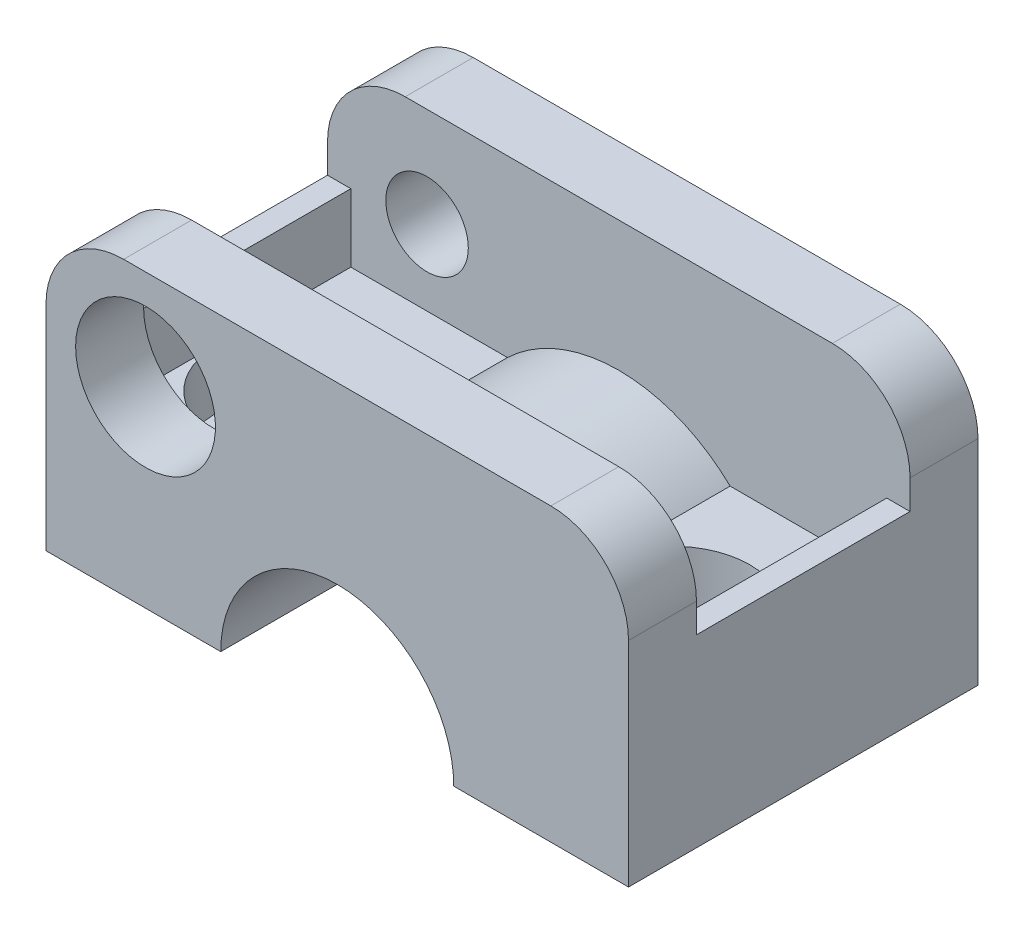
ISO-10303-21;
HEADER;
FILE_DESCRIPTION(('STEP AP214'),'2;1');
FILE_NAME('part.step','',(''),(''),'','','');
FILE_SCHEMA(('AUTOMOTIVE_DESIGN { 1 0 10303 214 1 1 1 1 }'));
ENDSEC;
DATA;
#1=APPLICATION_CONTEXT('core data for automotive mechanical design processes');
#2=APPLICATION_PROTOCOL_DEFINITION('international standard','automotive_design',2000,#1);
#3=PRODUCT_CONTEXT('',#1,'mechanical');
#4=PRODUCT('Part','Part','',(#3));
#5=PRODUCT_RELATED_PRODUCT_CATEGORY('part','',(#4));
#6=PRODUCT_DEFINITION_FORMATION('','',#4);
#7=PRODUCT_DEFINITION_CONTEXT('part definition',#1,'design');
#8=PRODUCT_DEFINITION('design','',#6,#7);
#9=PRODUCT_DEFINITION_SHAPE('','',#8);
#10=(LENGTH_UNIT() NAMED_UNIT(*) SI_UNIT(.MILLI.,.METRE.));
#11=(NAMED_UNIT(*) PLANE_ANGLE_UNIT() SI_UNIT($,.RADIAN.));
#12=(NAMED_UNIT(*) SI_UNIT($,.STERADIAN.) SOLID_ANGLE_UNIT());
#13=UNCERTAINTY_MEASURE_WITH_UNIT(LENGTH_MEASURE(1.E-05),#10,'distance_accuracy_value','');
#14=(GEOMETRIC_REPRESENTATION_CONTEXT(3) GLOBAL_UNCERTAINTY_ASSIGNED_CONTEXT((#13)) GLOBAL_UNIT_ASSIGNED_CONTEXT((#10,
#11,#12)) REPRESENTATION_CONTEXT('',''));
#15=CARTESIAN_POINT('',(0.,0.,0.));
#16=DIRECTION('',(0.,0.,1.));
#17=DIRECTION('',(1.,0.,0.));
#18=AXIS2_PLACEMENT_3D('',#15,#16,#17);
#19=CARTESIAN_POINT('',(13.8,6.,-5.5));
#20=DIRECTION('',(0.,-1.,0.));
#21=DIRECTION('',(0.,0.,-1.));
#22=AXIS2_PLACEMENT_3D('',#19,#20,#21);
#23=PLANE('',#22);
#24=DIRECTION('',(0.,0.,1.));
#25=VECTOR('',#24,1.);
#26=CARTESIAN_POINT('',(5.73498038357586,6.,-5.5));
#27=LINE('',#26,#25);
#28=CARTESIAN_POINT('',(5.73498038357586,6.,5.5));
#29=VERTEX_POINT('',#28);
#30=CARTESIAN_POINT('',(5.73498038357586,6.,-5.5));
#31=VERTEX_POINT('',#30);
#32=EDGE_CURVE('E58',#29,#31,#27,.F.);
#33=ORIENTED_EDGE('',*,*,#32,.F.);
#34=DIRECTION('',(1.,0.,0.));
#35=VECTOR('',#34,1.);
#36=CARTESIAN_POINT('',(0.,6.,5.5));
#37=LINE('',#36,#35);
#38=CARTESIAN_POINT('',(9.75000000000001,6.,5.5));
#39=VERTEX_POINT('',#38);
#40=EDGE_CURVE('E248',#39,#29,#37,.F.);
#41=ORIENTED_EDGE('',*,*,#40,.F.);
#42=CARTESIAN_POINT('',(9.75000000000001,6.,1.5));
#43=DIRECTION('',(0.,-1.,0.));
#44=DIRECTION('',(1.,0.,0.));
#45=AXIS2_PLACEMENT_3D('',#42,#43,#44);
#46=CIRCLE('',#45,4.);
#47=CARTESIAN_POINT('',(13.75,6.,1.5));
#48=VERTEX_POINT('',#47);
#49=EDGE_CURVE('E348',#48,#39,#46,.F.);
#50=ORIENTED_EDGE('',*,*,#49,.F.);
#51=EDGE_CURVE('E349',#39,#48,#46,.F.);
#52=ORIENTED_EDGE('',*,*,#51,.F.);
#53=CARTESIAN_POINT('',(13.8,6.,5.5));
#54=VERTEX_POINT('',#53);
#55=EDGE_CURVE('E33',#54,#39,#37,.F.);
#56=ORIENTED_EDGE('',*,*,#55,.F.);
#57=DIRECTION('',(0.,0.,-1.));
#58=VECTOR('',#57,1.);
#59=CARTESIAN_POINT('',(13.8,6.,-5.5));
#60=LINE('',#59,#58);
#61=CARTESIAN_POINT('',(13.8,6.,-5.5));
#62=VERTEX_POINT('',#61);
#63=EDGE_CURVE('E197',#54,#62,#60,.T.);
#64=ORIENTED_EDGE('',*,*,#63,.T.);
#65=DIRECTION('',(1.,0.,0.));
#66=VECTOR('',#65,1.);
#67=CARTESIAN_POINT('',(0.,6.,-5.5));
#68=LINE('',#67,#66);
#69=EDGE_CURVE('E195',#31,#62,#68,.T.);
#70=ORIENTED_EDGE('',*,*,#69,.F.);
#71=EDGE_LOOP('',(#33,#41,#50,#52,#56,#64,#70));
#72=FACE_BOUND('',#71,.T.);
#73=ADVANCED_FACE('F15',(#72),#23,.F.);
#74=CARTESIAN_POINT('',(0.,10.5256042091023,-5.5));
#75=DIRECTION('',(0.,0.,1.));
#76=DIRECTION('',(1.,0.,0.));
#77=AXIS2_PLACEMENT_3D('',#74,#75,#76);
#78=PLANE('',#77);
#79=CARTESIAN_POINT('',(-9.875,9.87499999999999,-5.5));
#80=DIRECTION('',(0.,0.,1.));
#81=DIRECTION('',(1.,0.,0.));
#82=AXIS2_PLACEMENT_3D('',#79,#80,#81);
#83=CIRCLE('',#82,2.125);
#84=CARTESIAN_POINT('',(-7.75,9.87499999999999,-5.5));
#85=VERTEX_POINT('',#84);
#86=EDGE_CURVE('E416',#85,#85,#83,.F.);
#87=ORIENTED_EDGE('',*,*,#86,.T.);
#88=EDGE_LOOP('',(#87));
#89=FACE_BOUND('',#88,.T.);
#90=CARTESIAN_POINT('',(11.,11.,-5.5));
#91=DIRECTION('',(0.,0.,1.));
#92=DIRECTION('',(1.,0.,0.));
#93=AXIS2_PLACEMENT_3D('',#90,#91,#92);
#94=CIRCLE('',#93,3.99999999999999);
#95=CARTESIAN_POINT('',(11.,15.,-5.5));
#96=VERTEX_POINT('',#95);
#97=CARTESIAN_POINT('',(15.,11.,-5.5));
#98=VERTEX_POINT('',#97);
#99=EDGE_CURVE('E412',#96,#98,#94,.F.);
#100=ORIENTED_EDGE('',*,*,#99,.F.);
#101=DIRECTION('',(1.,0.,0.));
#102=VECTOR('',#101,1.);
#103=CARTESIAN_POINT('',(-11.,15.,-5.5));
#104=LINE('',#103,#102);
#105=CARTESIAN_POINT('',(-11.,15.,-5.5));
#106=VERTEX_POINT('',#105);
#107=EDGE_CURVE('E406',#106,#96,#104,.T.);
#108=ORIENTED_EDGE('',*,*,#107,.F.);
#109=CARTESIAN_POINT('',(-11.,11.,-5.5));
#110=DIRECTION('',(0.,0.,1.));
#111=DIRECTION('',(1.,0.,0.));
#112=AXIS2_PLACEMENT_3D('',#109,#110,#111);
#113=CIRCLE('',#112,4.);
#114=CARTESIAN_POINT('',(-15.,11.,-5.5));
#115=VERTEX_POINT('',#114);
#116=EDGE_CURVE('E411',#115,#106,#113,.F.);
#117=ORIENTED_EDGE('',*,*,#116,.F.);
#118=DIRECTION('',(0.,1.,0.));
#119=VECTOR('',#118,1.);
#120=CARTESIAN_POINT('',(-15.,0.,-5.5));
#121=LINE('',#120,#119);
#122=CARTESIAN_POINT('',(-15.,9.5,-5.5));
#123=VERTEX_POINT('',#122);
#124=EDGE_CURVE('E414',#123,#115,#121,.T.);
#125=ORIENTED_EDGE('',*,*,#124,.F.);
#126=DIRECTION('',(1.,0.,0.));
#127=VECTOR('',#126,1.);
#128=CARTESIAN_POINT('',(0.,9.5,-5.5));
#129=LINE('',#128,#127);
#130=CARTESIAN_POINT('',(-13.8,9.5,-5.5));
#131=VERTEX_POINT('',#130);
#132=EDGE_CURVE('E67',#123,#131,#129,.T.);
#133=ORIENTED_EDGE('',*,*,#132,.T.);
#134=DIRECTION('',(0.,1.,0.));
#135=VECTOR('',#134,1.);
#136=CARTESIAN_POINT('',(-13.8,10.5256042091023,-5.5));
#137=LINE('',#136,#135);
#138=CARTESIAN_POINT('',(-13.8,6.,-5.5));
#139=VERTEX_POINT('',#138);
#140=EDGE_CURVE('E167',#131,#139,#137,.F.);
#141=ORIENTED_EDGE('',*,*,#140,.T.);
#142=DIRECTION('',(1.,0.,0.));
#143=VECTOR('',#142,1.);
#144=CARTESIAN_POINT('',(-9.76749019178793,6.,-5.5));
#145=LINE('',#144,#143);
#146=CARTESIAN_POINT('',(-5.73498055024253,6.,-5.5));
#147=VERTEX_POINT('',#146);
#148=EDGE_CURVE('E161',#139,#147,#145,.T.);
#149=ORIENTED_EDGE('',*,*,#148,.T.);
#150=CARTESIAN_POINT('',(0.,0.,-5.5));
#151=DIRECTION('',(0.,0.,1.));
#152=DIRECTION('',(1.,0.,0.));
#153=AXIS2_PLACEMENT_3D('',#150,#151,#152);
#154=CIRCLE('',#153,8.3);
#155=EDGE_CURVE('E172',#147,#31,#154,.F.);
#156=ORIENTED_EDGE('',*,*,#155,.T.);
#157=ORIENTED_EDGE('',*,*,#69,.T.);
#158=DIRECTION('',(0.,1.,0.));
#159=VECTOR('',#158,1.);
#160=CARTESIAN_POINT('',(13.8,10.5256042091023,-5.5));
#161=LINE('',#160,#159);
#162=CARTESIAN_POINT('',(13.8,9.5,-5.5));
#163=VERTEX_POINT('',#162);
#164=EDGE_CURVE('E204',#62,#163,#161,.T.);
#165=ORIENTED_EDGE('',*,*,#164,.T.);
#166=DIRECTION('',(1.,0.,0.));
#167=VECTOR('',#166,1.);
#168=CARTESIAN_POINT('',(0.,9.5,-5.5));
#169=LINE('',#168,#167);
#170=CARTESIAN_POINT('',(15.,9.5,-5.5));
#171=VERTEX_POINT('',#170);
#172=EDGE_CURVE('E206',#163,#171,#169,.T.);
#173=ORIENTED_EDGE('',*,*,#172,.T.);
#174=DIRECTION('',(0.,1.,0.));
#175=VECTOR('',#174,1.);
#176=CARTESIAN_POINT('',(15.,11.,-5.5));
#177=LINE('',#176,#175);
#178=EDGE_CURVE('E231',#98,#171,#177,.F.);
#179=ORIENTED_EDGE('',*,*,#178,.F.);
#180=EDGE_LOOP('',(#100,#108,#117,#125,#133,#141,#149,#156,#157,#165,#173,#179));
#181=FACE_BOUND('',#180,.T.);
#182=ADVANCED_FACE('F169',(#89,#181),#78,.T.);
#183=CARTESIAN_POINT('',(13.8,9.5,-5.5));
#184=DIRECTION('',(1.,0.,0.));
#185=DIRECTION('',(0.,0.,-1.));
#186=AXIS2_PLACEMENT_3D('',#183,#184,#185);
#187=PLANE('',#186);
#188=DIRECTION('',(0.,0.,-1.));
#189=VECTOR('',#188,1.);
#190=CARTESIAN_POINT('',(13.8,9.5,-5.5));
#191=LINE('',#190,#189);
#192=CARTESIAN_POINT('',(13.8,9.5,5.5));
#193=VERTEX_POINT('',#192);
#194=EDGE_CURVE('E200',#193,#163,#191,.T.);
#195=ORIENTED_EDGE('',*,*,#194,.T.);
#196=ORIENTED_EDGE('',*,*,#164,.F.);
#197=ORIENTED_EDGE('',*,*,#63,.F.);
#198=DIRECTION('',(0.,1.,0.));
#199=VECTOR('',#198,1.);
#200=CARTESIAN_POINT('',(13.8,9.5,5.5));
#201=LINE('',#200,#199);
#202=EDGE_CURVE('E194',#193,#54,#201,.F.);
#203=ORIENTED_EDGE('',*,*,#202,.F.);
#204=EDGE_LOOP('',(#195,#196,#197,#203));
#205=FACE_BOUND('',#204,.T.);
#206=ADVANCED_FACE('F220',(#205),#187,.F.);
#207=CARTESIAN_POINT('',(0.,0.,-5.5));
#208=DIRECTION('',(0.,0.,1.));
#209=DIRECTION('',(1.,0.,0.));
#210=AXIS2_PLACEMENT_3D('',#207,#208,#209);
#211=CYLINDRICAL_SURFACE('',#210,8.3);
#212=ORIENTED_EDGE('',*,*,#155,.F.);
#213=DIRECTION('',(0.,0.,1.));
#214=VECTOR('',#213,1.);
#215=CARTESIAN_POINT('',(-5.73498038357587,6.,0.));
#216=LINE('',#215,#214);
#217=CARTESIAN_POINT('',(-5.73498038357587,6.,5.49999983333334));
#218=VERTEX_POINT('',#217);
#219=EDGE_CURVE('E166',#147,#218,#216,.T.);
#220=ORIENTED_EDGE('',*,*,#219,.T.);
#221=CARTESIAN_POINT('',(0.,0.,5.5));
#222=DIRECTION('',(0.,0.,1.));
#223=DIRECTION('',(1.,0.,0.));
#224=AXIS2_PLACEMENT_3D('',#221,#222,#223);
#225=CIRCLE('',#224,8.3);
#226=EDGE_CURVE('E192',#218,#29,#225,.F.);
#227=ORIENTED_EDGE('',*,*,#226,.T.);
#228=ORIENTED_EDGE('',*,*,#32,.T.);
#229=EDGE_LOOP('',(#212,#220,#227,#228));
#230=FACE_BOUND('',#229,.T.);
#231=ADVANCED_FACE('F211',(#230),#211,.T.);
#232=CARTESIAN_POINT('',(-13.8,6.,-5.5));
#233=DIRECTION('',(-1.,0.,0.));
#234=DIRECTION('',(0.,0.,1.));
#235=AXIS2_PLACEMENT_3D('',#232,#233,#234);
#236=PLANE('',#235);
#237=DIRECTION('',(0.,0.,1.));
#238=VECTOR('',#237,1.);
#239=CARTESIAN_POINT('',(-13.8,6.,0.));
#240=LINE('',#239,#238);
#241=CARTESIAN_POINT('',(-13.8,6.,5.49999983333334));
#242=VERTEX_POINT('',#241);
#243=EDGE_CURVE('E18',#139,#242,#240,.T.);
#244=ORIENTED_EDGE('',*,*,#243,.F.);
#245=ORIENTED_EDGE('',*,*,#140,.F.);
#246=DIRECTION('',(0.,0.,-1.));
#247=VECTOR('',#246,1.);
#248=CARTESIAN_POINT('',(-13.8,9.5,-5.5));
#249=LINE('',#248,#247);
#250=CARTESIAN_POINT('',(-13.8,9.5,5.5));
#251=VERTEX_POINT('',#250);
#252=EDGE_CURVE('E191',#131,#251,#249,.F.);
#253=ORIENTED_EDGE('',*,*,#252,.T.);
#254=DIRECTION('',(0.,1.,0.));
#255=VECTOR('',#254,1.);
#256=CARTESIAN_POINT('',(-13.8,6.,5.5));
#257=LINE('',#256,#255);
#258=EDGE_CURVE('E176',#242,#251,#257,.T.);
#259=ORIENTED_EDGE('',*,*,#258,.F.);
#260=EDGE_LOOP('',(#244,#245,#253,#259));
#261=FACE_BOUND('',#260,.T.);
#262=ADVANCED_FACE('F174',(#261),#236,.F.);
#263=CARTESIAN_POINT('',(0.,10.5256042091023,5.5));
#264=DIRECTION('',(0.,0.,1.));
#265=DIRECTION('',(1.,0.,0.));
#266=AXIS2_PLACEMENT_3D('',#263,#264,#265);
#267=PLANE('',#266);
#268=CARTESIAN_POINT('',(-9.875,9.87499999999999,5.5));
#269=DIRECTION('',(0.,0.,-1.));
#270=DIRECTION('',(-1.,0.,0.));
#271=AXIS2_PLACEMENT_3D('',#268,#269,#270);
#272=CIRCLE('',#271,3.6);
#273=CARTESIAN_POINT('',(-13.475,9.87499999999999,5.5));
#274=VERTEX_POINT('',#273);
#275=EDGE_CURVE('E190',#274,#274,#272,.F.);
#276=ORIENTED_EDGE('',*,*,#275,.T.);
#277=EDGE_LOOP('',(#276));
#278=FACE_BOUND('',#277,.T.);
#279=CARTESIAN_POINT('',(11.,11.,5.5));
#280=DIRECTION('',(0.,0.,1.));
#281=DIRECTION('',(1.,0.,0.));
#282=AXIS2_PLACEMENT_3D('',#279,#280,#281);
#283=CIRCLE('',#282,3.99999999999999);
#284=CARTESIAN_POINT('',(15.,11.,5.5));
#285=VERTEX_POINT('',#284);
#286=CARTESIAN_POINT('',(11.,15.,5.5));
#287=VERTEX_POINT('',#286);
#288=EDGE_CURVE('E241',#285,#287,#283,.T.);
#289=ORIENTED_EDGE('',*,*,#288,.F.);
#290=DIRECTION('',(0.,1.,0.));
#291=VECTOR('',#290,1.);
#292=CARTESIAN_POINT('',(15.,10.5256042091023,5.5));
#293=LINE('',#292,#291);
#294=CARTESIAN_POINT('',(15.,9.5,5.5));
#295=VERTEX_POINT('',#294);
#296=EDGE_CURVE('E243',#295,#285,#293,.T.);
#297=ORIENTED_EDGE('',*,*,#296,.F.);
#298=DIRECTION('',(1.,0.,0.));
#299=VECTOR('',#298,1.);
#300=CARTESIAN_POINT('',(15.,9.5,5.5));
#301=LINE('',#300,#299);
#302=EDGE_CURVE('E246',#295,#193,#301,.F.);
#303=ORIENTED_EDGE('',*,*,#302,.T.);
#304=ORIENTED_EDGE('',*,*,#202,.T.);
#305=ORIENTED_EDGE('',*,*,#55,.T.);
#306=ORIENTED_EDGE('',*,*,#40,.T.);
#307=ORIENTED_EDGE('',*,*,#226,.F.);
#308=DIRECTION('',(1.,0.,0.));
#309=VECTOR('',#308,1.);
#310=CARTESIAN_POINT('',(-9.76749019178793,6.,5.5));
#311=LINE('',#310,#309);
#312=CARTESIAN_POINT('',(-9.75,6.,5.5));
#313=VERTEX_POINT('',#312);
#314=EDGE_CURVE('E208',#313,#218,#311,.T.);
#315=ORIENTED_EDGE('',*,*,#314,.F.);
#316=DIRECTION('',(1.,0.,0.));
#317=VECTOR('',#316,1.);
#318=CARTESIAN_POINT('',(-9.76749019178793,6.,5.5));
#319=LINE('',#318,#317);
#320=EDGE_CURVE('E10',#242,#313,#319,.T.);
#321=ORIENTED_EDGE('',*,*,#320,.F.);
#322=ORIENTED_EDGE('',*,*,#258,.T.);
#323=DIRECTION('',(1.,0.,0.));
#324=VECTOR('',#323,1.);
#325=CARTESIAN_POINT('',(-13.8,9.5,5.5));
#326=LINE('',#325,#324);
#327=CARTESIAN_POINT('',(-15.,9.5,5.5));
#328=VERTEX_POINT('',#327);
#329=EDGE_CURVE('E250',#251,#328,#326,.F.);
#330=ORIENTED_EDGE('',*,*,#329,.T.);
#331=DIRECTION('',(0.,1.,0.));
#332=VECTOR('',#331,1.);
#333=CARTESIAN_POINT('',(-15.,10.5256042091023,5.5));
#334=LINE('',#333,#332);
#335=CARTESIAN_POINT('',(-15.,11.,5.5));
#336=VERTEX_POINT('',#335);
#337=EDGE_CURVE('E252',#336,#328,#334,.F.);
#338=ORIENTED_EDGE('',*,*,#337,.F.);
#339=CARTESIAN_POINT('',(-11.,11.,5.5));
#340=DIRECTION('',(0.,0.,1.));
#341=DIRECTION('',(1.,0.,0.));
#342=AXIS2_PLACEMENT_3D('',#339,#340,#341);
#343=CIRCLE('',#342,4.);
#344=CARTESIAN_POINT('',(-11.,15.,5.5));
#345=VERTEX_POINT('',#344);
#346=EDGE_CURVE('E255',#345,#336,#343,.T.);
#347=ORIENTED_EDGE('',*,*,#346,.F.);
#348=DIRECTION('',(1.,0.,0.));
#349=VECTOR('',#348,1.);
#350=CARTESIAN_POINT('',(-11.,15.,5.5));
#351=LINE('',#350,#349);
#352=EDGE_CURVE('E258',#287,#345,#351,.F.);
#353=ORIENTED_EDGE('',*,*,#352,.F.);
#354=EDGE_LOOP('',(#289,#297,#303,#304,#305,#306,#307,#315,#321,#322,#330,#338,#347,#353));
#355=FACE_BOUND('',#354,.T.);
#356=ADVANCED_FACE('F452',(#278,#355),#267,.F.);
#357=CARTESIAN_POINT('',(-9.875,9.87499999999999,9.));
#358=DIRECTION('',(0.,0.,-1.));
#359=DIRECTION('',(-1.,0.,0.));
#360=AXIS2_PLACEMENT_3D('',#357,#358,#359);
#361=CYLINDRICAL_SURFACE('',#360,3.6);
#362=CARTESIAN_POINT('',(-9.875,9.87499999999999,9.));
#363=DIRECTION('',(0.,0.,-1.));
#364=DIRECTION('',(-1.,0.,0.));
#365=AXIS2_PLACEMENT_3D('',#362,#363,#364);
#366=CIRCLE('',#365,3.6);
#367=CARTESIAN_POINT('',(-13.475,9.87499999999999,9.));
#368=VERTEX_POINT('',#367);
#369=EDGE_CURVE('E261',#368,#368,#366,.T.);
#370=ORIENTED_EDGE('',*,*,#369,.F.);
#371=EDGE_LOOP('',(#370));
#372=FACE_BOUND('',#371,.T.);
#373=ORIENTED_EDGE('',*,*,#275,.F.);
#374=EDGE_LOOP('',(#373));
#375=FACE_BOUND('',#374,.T.);
#376=ADVANCED_FACE('F454',(#372,#375),#361,.F.);
#377=CARTESIAN_POINT('',(11.,11.,0.));
#378=DIRECTION('',(0.,0.,1.));
#379=DIRECTION('',(1.,0.,0.));
#380=AXIS2_PLACEMENT_3D('',#377,#378,#379);
#381=CYLINDRICAL_SURFACE('',#380,3.99999999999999);
#382=CARTESIAN_POINT('',(11.,11.,9.));
#383=DIRECTION('',(0.,0.,1.));
#384=DIRECTION('',(1.,0.,0.));
#385=AXIS2_PLACEMENT_3D('',#382,#383,#384);
#386=CIRCLE('',#385,3.99999999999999);
#387=CARTESIAN_POINT('',(15.,11.,9.));
#388=VERTEX_POINT('',#387);
#389=CARTESIAN_POINT('',(11.,15.,9.));
#390=VERTEX_POINT('',#389);
#391=EDGE_CURVE('E264',#388,#390,#386,.T.);
#392=ORIENTED_EDGE('',*,*,#391,.F.);
#393=DIRECTION('',(0.,0.,-1.));
#394=VECTOR('',#393,1.);
#395=CARTESIAN_POINT('',(15.,11.,0.));
#396=LINE('',#395,#394);
#397=EDGE_CURVE('E266',#285,#388,#396,.F.);
#398=ORIENTED_EDGE('',*,*,#397,.F.);
#399=ORIENTED_EDGE('',*,*,#288,.T.);
#400=DIRECTION('',(0.,0.,1.));
#401=VECTOR('',#400,1.);
#402=CARTESIAN_POINT('',(11.,15.,0.));
#403=LINE('',#402,#401);
#404=EDGE_CURVE('E269',#287,#390,#403,.T.);
#405=ORIENTED_EDGE('',*,*,#404,.T.);
#406=EDGE_LOOP('',(#392,#398,#399,#405));
#407=FACE_BOUND('',#406,.T.);
#408=ADVANCED_FACE('F380',(#407),#381,.T.);
#409=CARTESIAN_POINT('',(15.,11.,0.));
#410=DIRECTION('',(1.,0.,0.));
#411=DIRECTION('',(0.,0.,-1.));
#412=AXIS2_PLACEMENT_3D('',#409,#410,#411);
#413=PLANE('',#412);
#414=DIRECTION('',(0.,1.,0.));
#415=VECTOR('',#414,1.);
#416=CARTESIAN_POINT('',(15.,7.3377343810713,-9.));
#417=LINE('',#416,#415);
#418=CARTESIAN_POINT('',(15.,0.,-9.));
#419=VERTEX_POINT('',#418);
#420=CARTESIAN_POINT('',(15.,11.,-9.));
#421=VERTEX_POINT('',#420);
#422=EDGE_CURVE('E272',#419,#421,#417,.T.);
#423=ORIENTED_EDGE('',*,*,#422,.T.);
#424=DIRECTION('',(0.,0.,1.));
#425=VECTOR('',#424,1.);
#426=CARTESIAN_POINT('',(15.,11.,0.));
#427=LINE('',#426,#425);
#428=EDGE_CURVE('E274',#98,#421,#427,.F.);
#429=ORIENTED_EDGE('',*,*,#428,.F.);
#430=ORIENTED_EDGE('',*,*,#178,.T.);
#431=DIRECTION('',(0.,0.,-1.));
#432=VECTOR('',#431,1.);
#433=CARTESIAN_POINT('',(15.,9.5,0.));
#434=LINE('',#433,#432);
#435=EDGE_CURVE('E230',#171,#295,#434,.F.);
#436=ORIENTED_EDGE('',*,*,#435,.T.);
#437=ORIENTED_EDGE('',*,*,#296,.T.);
#438=ORIENTED_EDGE('',*,*,#397,.T.);
#439=DIRECTION('',(0.,1.,0.));
#440=VECTOR('',#439,1.);
#441=CARTESIAN_POINT('',(15.,11.,9.));
#442=LINE('',#441,#440);
#443=CARTESIAN_POINT('',(15.,0.,9.));
#444=VERTEX_POINT('',#443);
#445=EDGE_CURVE('E278',#388,#444,#442,.F.);
#446=ORIENTED_EDGE('',*,*,#445,.T.);
#447=DIRECTION('',(0.,0.,-1.));
#448=VECTOR('',#447,1.);
#449=CARTESIAN_POINT('',(15.,0.,0.));
#450=LINE('',#449,#448);
#451=EDGE_CURVE('E280',#419,#444,#450,.F.);
#452=ORIENTED_EDGE('',*,*,#451,.F.);
#453=EDGE_LOOP('',(#423,#429,#430,#436,#437,#438,#446,#452));
#454=FACE_BOUND('',#453,.T.);
#455=ADVANCED_FACE('F374',(#454),#413,.T.);
#456=CARTESIAN_POINT('',(15.,9.5,-5.5));
#457=DIRECTION('',(0.,-1.,0.));
#458=DIRECTION('',(0.,0.,-1.));
#459=AXIS2_PLACEMENT_3D('',#456,#457,#458);
#460=PLANE('',#459);
#461=ORIENTED_EDGE('',*,*,#435,.F.);
#462=ORIENTED_EDGE('',*,*,#172,.F.);
#463=ORIENTED_EDGE('',*,*,#194,.F.);
#464=ORIENTED_EDGE('',*,*,#302,.F.);
#465=EDGE_LOOP('',(#461,#462,#463,#464));
#466=FACE_BOUND('',#465,.T.);
#467=ADVANCED_FACE('F227',(#466),#460,.F.);
#468=CARTESIAN_POINT('',(-13.8,9.5,-5.5));
#469=DIRECTION('',(0.,-1.,0.));
#470=DIRECTION('',(0.,0.,-1.));
#471=AXIS2_PLACEMENT_3D('',#468,#469,#470);
#472=PLANE('',#471);
#473=ORIENTED_EDGE('',*,*,#252,.F.);
#474=ORIENTED_EDGE('',*,*,#132,.F.);
#475=DIRECTION('',(0.,0.,1.));
#476=VECTOR('',#475,1.);
#477=CARTESIAN_POINT('',(-15.,9.5,0.));
#478=LINE('',#477,#476);
#479=EDGE_CURVE('E283',#328,#123,#478,.F.);
#480=ORIENTED_EDGE('',*,*,#479,.F.);
#481=ORIENTED_EDGE('',*,*,#329,.F.);
#482=EDGE_LOOP('',(#473,#474,#480,#481));
#483=FACE_BOUND('',#482,.T.);
#484=ADVANCED_FACE('F465',(#483),#472,.F.);
#485=CARTESIAN_POINT('',(-15.,0.,0.));
#486=DIRECTION('',(-1.,0.,0.));
#487=DIRECTION('',(0.,0.,1.));
#488=AXIS2_PLACEMENT_3D('',#485,#486,#487);
#489=PLANE('',#488);
#490=DIRECTION('',(0.,1.,0.));
#491=VECTOR('',#490,1.);
#492=CARTESIAN_POINT('',(-15.,0.,9.));
#493=LINE('',#492,#491);
#494=CARTESIAN_POINT('',(-15.,0.,9.));
#495=VERTEX_POINT('',#494);
#496=CARTESIAN_POINT('',(-15.,11.,9.));
#497=VERTEX_POINT('',#496);
#498=EDGE_CURVE('E286',#495,#497,#493,.T.);
#499=ORIENTED_EDGE('',*,*,#498,.T.);
#500=DIRECTION('',(0.,0.,1.));
#501=VECTOR('',#500,1.);
#502=CARTESIAN_POINT('',(-15.,11.,0.));
#503=LINE('',#502,#501);
#504=EDGE_CURVE('E288',#497,#336,#503,.F.);
#505=ORIENTED_EDGE('',*,*,#504,.T.);
#506=ORIENTED_EDGE('',*,*,#337,.T.);
#507=ORIENTED_EDGE('',*,*,#479,.T.);
#508=ORIENTED_EDGE('',*,*,#124,.T.);
#509=DIRECTION('',(0.,0.,1.));
#510=VECTOR('',#509,1.);
#511=CARTESIAN_POINT('',(-15.,11.,0.));
#512=LINE('',#511,#510);
#513=CARTESIAN_POINT('',(-15.,11.,-9.));
#514=VERTEX_POINT('',#513);
#515=EDGE_CURVE('E291',#115,#514,#512,.F.);
#516=ORIENTED_EDGE('',*,*,#515,.T.);
#517=DIRECTION('',(0.,1.,0.));
#518=VECTOR('',#517,1.);
#519=CARTESIAN_POINT('',(-15.,7.3377343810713,-9.));
#520=LINE('',#519,#518);
#521=CARTESIAN_POINT('',(-15.,0.,-9.));
#522=VERTEX_POINT('',#521);
#523=EDGE_CURVE('E293',#514,#522,#520,.F.);
#524=ORIENTED_EDGE('',*,*,#523,.T.);
#525=DIRECTION('',(0.,0.,-1.));
#526=VECTOR('',#525,1.);
#527=CARTESIAN_POINT('',(-15.,0.,0.));
#528=LINE('',#527,#526);
#529=EDGE_CURVE('E295',#495,#522,#528,.T.);
#530=ORIENTED_EDGE('',*,*,#529,.F.);
#531=EDGE_LOOP('',(#499,#505,#506,#507,#508,#516,#524,#530));
#532=FACE_BOUND('',#531,.T.);
#533=ADVANCED_FACE('F390',(#532),#489,.T.);
#534=CARTESIAN_POINT('',(-11.,11.,0.));
#535=DIRECTION('',(0.,0.,1.));
#536=DIRECTION('',(1.,0.,0.));
#537=AXIS2_PLACEMENT_3D('',#534,#535,#536);
#538=CYLINDRICAL_SURFACE('',#537,4.);
#539=CARTESIAN_POINT('',(-11.,11.,9.));
#540=DIRECTION('',(0.,0.,1.));
#541=DIRECTION('',(1.,0.,0.));
#542=AXIS2_PLACEMENT_3D('',#539,#540,#541);
#543=CIRCLE('',#542,4.);
#544=CARTESIAN_POINT('',(-11.,15.,9.));
#545=VERTEX_POINT('',#544);
#546=EDGE_CURVE('E298',#545,#497,#543,.T.);
#547=ORIENTED_EDGE('',*,*,#546,.F.);
#548=DIRECTION('',(0.,0.,1.));
#549=VECTOR('',#548,1.);
#550=CARTESIAN_POINT('',(-11.,15.,0.));
#551=LINE('',#550,#549);
#552=EDGE_CURVE('E301',#545,#345,#551,.F.);
#553=ORIENTED_EDGE('',*,*,#552,.T.);
#554=ORIENTED_EDGE('',*,*,#346,.T.);
#555=ORIENTED_EDGE('',*,*,#504,.F.);
#556=EDGE_LOOP('',(#547,#553,#554,#555));
#557=FACE_BOUND('',#556,.T.);
#558=ADVANCED_FACE('F386',(#557),#538,.T.);
#559=CARTESIAN_POINT('',(-11.,15.,0.));
#560=DIRECTION('',(0.,1.,0.));
#561=DIRECTION('',(0.,0.,1.));
#562=AXIS2_PLACEMENT_3D('',#559,#560,#561);
#563=PLANE('',#562);
#564=DIRECTION('',(1.,0.,0.));
#565=VECTOR('',#564,1.);
#566=CARTESIAN_POINT('',(0.,15.,9.));
#567=LINE('',#566,#565);
#568=EDGE_CURVE('E304',#390,#545,#567,.F.);
#569=ORIENTED_EDGE('',*,*,#568,.F.);
#570=ORIENTED_EDGE('',*,*,#404,.F.);
#571=ORIENTED_EDGE('',*,*,#352,.T.);
#572=ORIENTED_EDGE('',*,*,#552,.F.);
#573=EDGE_LOOP('',(#569,#570,#571,#572));
#574=FACE_BOUND('',#573,.T.);
#575=ADVANCED_FACE('F384',(#574),#563,.T.);
#576=CARTESIAN_POINT('',(-9.875,9.87499999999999,0.));
#577=DIRECTION('',(0.,0.,1.));
#578=DIRECTION('',(1.,0.,0.));
#579=AXIS2_PLACEMENT_3D('',#576,#577,#578);
#580=CYLINDRICAL_SURFACE('',#579,2.125);
#581=ORIENTED_EDGE('',*,*,#86,.F.);
#582=EDGE_LOOP('',(#581));
#583=FACE_BOUND('',#582,.T.);
#584=CARTESIAN_POINT('',(-9.875,9.87499999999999,-9.));
#585=DIRECTION('',(0.,0.,1.));
#586=DIRECTION('',(1.,0.,0.));
#587=AXIS2_PLACEMENT_3D('',#584,#585,#586);
#588=CIRCLE('',#587,2.125);
#589=CARTESIAN_POINT('',(-7.75,9.87499999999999,-9.));
#590=VERTEX_POINT('',#589);
#591=EDGE_CURVE('E307',#590,#590,#588,.F.);
#592=ORIENTED_EDGE('',*,*,#591,.T.);
#593=EDGE_LOOP('',(#592));
#594=FACE_BOUND('',#593,.T.);
#595=ADVANCED_FACE('F475',(#583,#594),#580,.F.);
#596=CARTESIAN_POINT('',(11.,11.,0.));
#597=DIRECTION('',(0.,0.,1.));
#598=DIRECTION('',(1.,0.,0.));
#599=AXIS2_PLACEMENT_3D('',#596,#597,#598);
#600=CYLINDRICAL_SURFACE('',#599,3.99999999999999);
#601=CARTESIAN_POINT('',(11.,11.,-9.));
#602=DIRECTION('',(0.,0.,1.));
#603=DIRECTION('',(1.,0.,0.));
#604=AXIS2_PLACEMENT_3D('',#601,#602,#603);
#605=CIRCLE('',#604,3.99999999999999);
#606=CARTESIAN_POINT('',(11.,15.,-9.));
#607=VERTEX_POINT('',#606);
#608=EDGE_CURVE('E310',#421,#607,#605,.T.);
#609=ORIENTED_EDGE('',*,*,#608,.T.);
#610=DIRECTION('',(0.,0.,1.));
#611=VECTOR('',#610,1.);
#612=CARTESIAN_POINT('',(11.,15.,0.));
#613=LINE('',#612,#611);
#614=EDGE_CURVE('E312',#96,#607,#613,.F.);
#615=ORIENTED_EDGE('',*,*,#614,.F.);
#616=ORIENTED_EDGE('',*,*,#99,.T.);
#617=ORIENTED_EDGE('',*,*,#428,.T.);
#618=EDGE_LOOP('',(#609,#615,#616,#617));
#619=FACE_BOUND('',#618,.T.);
#620=ADVANCED_FACE('F399',(#619),#600,.T.);
#621=CARTESIAN_POINT('',(-11.,15.,0.));
#622=DIRECTION('',(0.,1.,0.));
#623=DIRECTION('',(0.,0.,1.));
#624=AXIS2_PLACEMENT_3D('',#621,#622,#623);
#625=PLANE('',#624);
#626=DIRECTION('',(1.,0.,0.));
#627=VECTOR('',#626,1.);
#628=CARTESIAN_POINT('',(0.,15.,-9.));
#629=LINE('',#628,#627);
#630=CARTESIAN_POINT('',(-11.,15.,-9.));
#631=VERTEX_POINT('',#630);
#632=EDGE_CURVE('E315',#607,#631,#629,.F.);
#633=ORIENTED_EDGE('',*,*,#632,.T.);
#634=DIRECTION('',(0.,0.,1.));
#635=VECTOR('',#634,1.);
#636=CARTESIAN_POINT('',(-11.,15.,0.));
#637=LINE('',#636,#635);
#638=EDGE_CURVE('E317',#106,#631,#637,.F.);
#639=ORIENTED_EDGE('',*,*,#638,.F.);
#640=ORIENTED_EDGE('',*,*,#107,.T.);
#641=ORIENTED_EDGE('',*,*,#614,.T.);
#642=EDGE_LOOP('',(#633,#639,#640,#641));
#643=FACE_BOUND('',#642,.T.);
#644=ADVANCED_FACE('F403',(#643),#625,.T.);
#645=CARTESIAN_POINT('',(-11.,11.,0.));
#646=DIRECTION('',(0.,0.,1.));
#647=DIRECTION('',(1.,0.,0.));
#648=AXIS2_PLACEMENT_3D('',#645,#646,#647);
#649=CYLINDRICAL_SURFACE('',#648,4.);
#650=CARTESIAN_POINT('',(-11.,11.,-9.));
#651=DIRECTION('',(0.,0.,1.));
#652=DIRECTION('',(1.,0.,0.));
#653=AXIS2_PLACEMENT_3D('',#650,#651,#652);
#654=CIRCLE('',#653,4.);
#655=EDGE_CURVE('E320',#631,#514,#654,.T.);
#656=ORIENTED_EDGE('',*,*,#655,.T.);
#657=ORIENTED_EDGE('',*,*,#515,.F.);
#658=ORIENTED_EDGE('',*,*,#116,.T.);
#659=ORIENTED_EDGE('',*,*,#638,.T.);
#660=EDGE_LOOP('',(#656,#657,#658,#659));
#661=FACE_BOUND('',#660,.T.);
#662=ADVANCED_FACE('F423',(#661),#649,.T.);
#663=CARTESIAN_POINT('',(0.,7.3377343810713,9.));
#664=DIRECTION('',(0.,0.,1.));
#665=DIRECTION('',(1.,0.,0.));
#666=AXIS2_PLACEMENT_3D('',#663,#664,#665);
#667=PLANE('',#666);
#668=ORIENTED_EDGE('',*,*,#369,.T.);
#669=EDGE_LOOP('',(#668));
#670=FACE_BOUND('',#669,.T.);
#671=ORIENTED_EDGE('',*,*,#546,.T.);
#672=ORIENTED_EDGE('',*,*,#498,.F.);
#673=DIRECTION('',(1.,0.,0.));
#674=VECTOR('',#673,1.);
#675=CARTESIAN_POINT('',(-6.,0.,9.));
#676=LINE('',#675,#674);
#677=CARTESIAN_POINT('',(-6.,0.,9.));
#678=VERTEX_POINT('',#677);
#679=EDGE_CURVE('E323',#678,#495,#676,.F.);
#680=ORIENTED_EDGE('',*,*,#679,.F.);
#681=CARTESIAN_POINT('',(0.,0.,9.));
#682=DIRECTION('',(0.,0.,1.));
#683=DIRECTION('',(1.,0.,0.));
#684=AXIS2_PLACEMENT_3D('',#681,#682,#683);
#685=CIRCLE('',#684,6.);
#686=CARTESIAN_POINT('',(6.,0.,9.));
#687=VERTEX_POINT('',#686);
#688=EDGE_CURVE('E326',#678,#687,#685,.F.);
#689=ORIENTED_EDGE('',*,*,#688,.T.);
#690=DIRECTION('',(1.,0.,0.));
#691=VECTOR('',#690,1.);
#692=CARTESIAN_POINT('',(15.,0.,9.));
#693=LINE('',#692,#691);
#694=EDGE_CURVE('E328',#444,#687,#693,.F.);
#695=ORIENTED_EDGE('',*,*,#694,.F.);
#696=ORIENTED_EDGE('',*,*,#445,.F.);
#697=ORIENTED_EDGE('',*,*,#391,.T.);
#698=ORIENTED_EDGE('',*,*,#568,.T.);
#699=EDGE_LOOP('',(#671,#672,#680,#689,#695,#696,#697,#698));
#700=FACE_BOUND('',#699,.T.);
#701=ADVANCED_FACE('F368',(#670,#700),#667,.T.);
#702=CARTESIAN_POINT('',(0.,7.3377343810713,-9.));
#703=DIRECTION('',(0.,0.,1.));
#704=DIRECTION('',(1.,0.,0.));
#705=AXIS2_PLACEMENT_3D('',#702,#703,#704);
#706=PLANE('',#705);
#707=ORIENTED_EDGE('',*,*,#591,.F.);
#708=EDGE_LOOP('',(#707));
#709=FACE_BOUND('',#708,.T.);
#710=CARTESIAN_POINT('',(0.,0.,-9.));
#711=DIRECTION('',(0.,0.,1.));
#712=DIRECTION('',(1.,0.,0.));
#713=AXIS2_PLACEMENT_3D('',#710,#711,#712);
#714=CIRCLE('',#713,6.);
#715=CARTESIAN_POINT('',(-6.,0.,-9.));
#716=VERTEX_POINT('',#715);
#717=CARTESIAN_POINT('',(6.,0.,-9.));
#718=VERTEX_POINT('',#717);
#719=EDGE_CURVE('E331',#716,#718,#714,.F.);
#720=ORIENTED_EDGE('',*,*,#719,.F.);
#721=DIRECTION('',(1.,0.,0.));
#722=VECTOR('',#721,1.);
#723=CARTESIAN_POINT('',(0.,0.,-9.));
#724=LINE('',#723,#722);
#725=EDGE_CURVE('E333',#522,#716,#724,.T.);
#726=ORIENTED_EDGE('',*,*,#725,.F.);
#727=ORIENTED_EDGE('',*,*,#523,.F.);
#728=ORIENTED_EDGE('',*,*,#655,.F.);
#729=ORIENTED_EDGE('',*,*,#632,.F.);
#730=ORIENTED_EDGE('',*,*,#608,.F.);
#731=ORIENTED_EDGE('',*,*,#422,.F.);
#732=DIRECTION('',(1.,0.,0.));
#733=VECTOR('',#732,1.);
#734=CARTESIAN_POINT('',(0.,0.,-9.));
#735=LINE('',#734,#733);
#736=EDGE_CURVE('E336',#718,#419,#735,.T.);
#737=ORIENTED_EDGE('',*,*,#736,.F.);
#738=EDGE_LOOP('',(#720,#726,#727,#728,#729,#730,#731,#737));
#739=FACE_BOUND('',#738,.T.);
#740=ADVANCED_FACE('F393',(#709,#739),#706,.F.);
#741=CARTESIAN_POINT('',(15.,0.,0.));
#742=DIRECTION('',(0.,-1.,0.));
#743=DIRECTION('',(0.,0.,-1.));
#744=AXIS2_PLACEMENT_3D('',#741,#742,#743);
#745=PLANE('',#744);
#746=CARTESIAN_POINT('',(9.75000000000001,0.,1.5));
#747=DIRECTION('',(0.,1.,0.));
#748=DIRECTION('',(0.,0.,1.));
#749=AXIS2_PLACEMENT_3D('',#746,#747,#748);
#750=CIRCLE('',#749,2.1);
#751=CARTESIAN_POINT('',(9.75000000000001,0.,3.6));
#752=VERTEX_POINT('',#751);
#753=EDGE_CURVE('E339',#752,#752,#750,.T.);
#754=ORIENTED_EDGE('',*,*,#753,.T.);
#755=EDGE_LOOP('',(#754));
#756=FACE_BOUND('',#755,.T.);
#757=ORIENTED_EDGE('',*,*,#736,.T.);
#758=ORIENTED_EDGE('',*,*,#451,.T.);
#759=ORIENTED_EDGE('',*,*,#694,.T.);
#760=DIRECTION('',(0.,0.,-1.));
#761=VECTOR('',#760,1.);
#762=CARTESIAN_POINT('',(6.,0.,0.));
#763=LINE('',#762,#761);
#764=EDGE_CURVE('E342',#687,#718,#763,.T.);
#765=ORIENTED_EDGE('',*,*,#764,.T.);
#766=EDGE_LOOP('',(#757,#758,#759,#765));
#767=FACE_BOUND('',#766,.T.);
#768=ADVANCED_FACE('F371',(#756,#767),#745,.T.);
#769=CARTESIAN_POINT('',(9.75000000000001,6.00000000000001,1.5));
#770=DIRECTION('',(0.,-1.,0.));
#771=DIRECTION('',(1.,0.,0.));
#772=AXIS2_PLACEMENT_3D('',#769,#770,#771);
#773=CYLINDRICAL_SURFACE('',#772,4.);
#774=CARTESIAN_POINT('',(9.75000000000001,3.,1.5));
#775=DIRECTION('',(0.,-1.,0.));
#776=DIRECTION('',(1.,0.,0.));
#777=AXIS2_PLACEMENT_3D('',#774,#775,#776);
#778=CIRCLE('',#777,4.);
#779=CARTESIAN_POINT('',(13.75,3.,1.5));
#780=VERTEX_POINT('',#779);
#781=EDGE_CURVE('E345',#780,#780,#778,.T.);
#782=ORIENTED_EDGE('',*,*,#781,.T.);
#783=EDGE_LOOP('',(#782));
#784=FACE_BOUND('',#783,.T.);
#785=ORIENTED_EDGE('',*,*,#51,.T.);
#786=ORIENTED_EDGE('',*,*,#49,.T.);
#787=EDGE_LOOP('',(#785,#786));
#788=FACE_BOUND('',#787,.T.);
#789=ADVANCED_FACE('F513',(#784,#788),#773,.F.);
#790=CARTESIAN_POINT('',(13.83,3.,5.58));
#791=DIRECTION('',(0.,-1.,0.));
#792=DIRECTION('',(-1.,0.,0.));
#793=AXIS2_PLACEMENT_3D('',#790,#791,#792);
#794=PLANE('',#793);
#795=CARTESIAN_POINT('',(9.75000000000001,3.,1.5));
#796=DIRECTION('',(0.,1.,0.));
#797=DIRECTION('',(0.,0.,1.));
#798=AXIS2_PLACEMENT_3D('',#795,#796,#797);
#799=CIRCLE('',#798,2.1);
#800=CARTESIAN_POINT('',(9.75000000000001,3.,3.6));
#801=VERTEX_POINT('',#800);
#802=EDGE_CURVE('E351',#801,#801,#799,.F.);
#803=ORIENTED_EDGE('',*,*,#802,.T.);
#804=EDGE_LOOP('',(#803));
#805=FACE_BOUND('',#804,.T.);
#806=ORIENTED_EDGE('',*,*,#781,.F.);
#807=EDGE_LOOP('',(#806));
#808=FACE_BOUND('',#807,.T.);
#809=ADVANCED_FACE('F521',(#805,#808),#794,.F.);
#810=CARTESIAN_POINT('',(9.75000000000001,0.,1.5));
#811=DIRECTION('',(0.,1.,0.));
#812=DIRECTION('',(0.,0.,1.));
#813=AXIS2_PLACEMENT_3D('',#810,#811,#812);
#814=CYLINDRICAL_SURFACE('',#813,2.1);
#815=ORIENTED_EDGE('',*,*,#753,.F.);
#816=EDGE_LOOP('',(#815));
#817=FACE_BOUND('',#816,.T.);
#818=ORIENTED_EDGE('',*,*,#802,.F.);
#819=EDGE_LOOP('',(#818));
#820=FACE_BOUND('',#819,.T.);
#821=ADVANCED_FACE('F529',(#817,#820),#814,.F.);
#822=CARTESIAN_POINT('',(-6.,0.,0.));
#823=DIRECTION('',(0.,-1.,0.));
#824=DIRECTION('',(0.,0.,-1.));
#825=AXIS2_PLACEMENT_3D('',#822,#823,#824);
#826=PLANE('',#825);
#827=CARTESIAN_POINT('',(-9.75,0.,1.5));
#828=DIRECTION('',(0.,1.,0.));
#829=DIRECTION('',(0.,0.,1.));
#830=AXIS2_PLACEMENT_3D('',#827,#828,#829);
#831=CIRCLE('',#830,2.1);
#832=CARTESIAN_POINT('',(-9.75,0.,3.6));
#833=VERTEX_POINT('',#832);
#834=EDGE_CURVE('E354',#833,#833,#831,.T.);
#835=ORIENTED_EDGE('',*,*,#834,.T.);
#836=EDGE_LOOP('',(#835));
#837=FACE_BOUND('',#836,.T.);
#838=ORIENTED_EDGE('',*,*,#725,.T.);
#839=DIRECTION('',(0.,0.,1.));
#840=VECTOR('',#839,1.);
#841=CARTESIAN_POINT('',(-6.,0.,0.));
#842=LINE('',#841,#840);
#843=EDGE_CURVE('E185',#716,#678,#842,.T.);
#844=ORIENTED_EDGE('',*,*,#843,.T.);
#845=ORIENTED_EDGE('',*,*,#679,.T.);
#846=ORIENTED_EDGE('',*,*,#529,.T.);
#847=EDGE_LOOP('',(#838,#844,#845,#846));
#848=FACE_BOUND('',#847,.T.);
#849=ADVANCED_FACE('F359',(#837,#848),#826,.T.);
#850=CARTESIAN_POINT('',(-9.75,6.,1.5));
#851=DIRECTION('',(0.,-1.,0.));
#852=DIRECTION('',(0.,0.,-1.));
#853=AXIS2_PLACEMENT_3D('',#850,#851,#852);
#854=CYLINDRICAL_SURFACE('',#853,4.);
#855=CARTESIAN_POINT('',(-9.75,3.,1.5));
#856=DIRECTION('',(0.,-1.,0.));
#857=DIRECTION('',(0.,0.,-1.));
#858=AXIS2_PLACEMENT_3D('',#855,#856,#857);
#859=CIRCLE('',#858,4.);
#860=CARTESIAN_POINT('',(-9.75,3.,-2.5));
#861=VERTEX_POINT('',#860);
#862=EDGE_CURVE('E180',#861,#861,#859,.T.);
#863=ORIENTED_EDGE('',*,*,#862,.T.);
#864=EDGE_LOOP('',(#863));
#865=FACE_BOUND('',#864,.T.);
#866=CARTESIAN_POINT('',(-9.75,6.,1.5));
#867=DIRECTION('',(0.,-1.,0.));
#868=DIRECTION('',(0.,0.,-1.));
#869=AXIS2_PLACEMENT_3D('',#866,#867,#868);
#870=CIRCLE('',#869,4.);
#871=EDGE_CURVE('E24',#313,#313,#870,.T.);
#872=ORIENTED_EDGE('',*,*,#871,.F.);
#873=EDGE_LOOP('',(#872));
#874=FACE_BOUND('',#873,.T.);
#875=ADVANCED_FACE('F544',(#865,#874),#854,.F.);
#876=CARTESIAN_POINT('',(-5.67,3.,5.58));
#877=DIRECTION('',(0.,-1.,0.));
#878=DIRECTION('',(-1.,0.,0.));
#879=AXIS2_PLACEMENT_3D('',#876,#877,#878);
#880=PLANE('',#879);
#881=CARTESIAN_POINT('',(-9.75,3.,1.5));
#882=DIRECTION('',(0.,1.,0.));
#883=DIRECTION('',(0.,0.,1.));
#884=AXIS2_PLACEMENT_3D('',#881,#882,#883);
#885=CIRCLE('',#884,2.1);
#886=CARTESIAN_POINT('',(-9.75,3.,3.6));
#887=VERTEX_POINT('',#886);
#888=EDGE_CURVE('E178',#887,#887,#885,.F.);
#889=ORIENTED_EDGE('',*,*,#888,.T.);
#890=EDGE_LOOP('',(#889));
#891=FACE_BOUND('',#890,.T.);
#892=ORIENTED_EDGE('',*,*,#862,.F.);
#893=EDGE_LOOP('',(#892));
#894=FACE_BOUND('',#893,.T.);
#895=ADVANCED_FACE('F552',(#891,#894),#880,.F.);
#896=CARTESIAN_POINT('',(-9.75,0.,1.5));
#897=DIRECTION('',(0.,1.,0.));
#898=DIRECTION('',(0.,0.,1.));
#899=AXIS2_PLACEMENT_3D('',#896,#897,#898);
#900=CYLINDRICAL_SURFACE('',#899,2.1);
#901=ORIENTED_EDGE('',*,*,#834,.F.);
#902=EDGE_LOOP('',(#901));
#903=FACE_BOUND('',#902,.T.);
#904=ORIENTED_EDGE('',*,*,#888,.F.);
#905=EDGE_LOOP('',(#904));
#906=FACE_BOUND('',#905,.T.);
#907=ADVANCED_FACE('F441',(#903,#906),#900,.F.);
#908=CARTESIAN_POINT('',(0.,0.,0.));
#909=DIRECTION('',(0.,0.,1.));
#910=DIRECTION('',(1.,0.,0.));
#911=AXIS2_PLACEMENT_3D('',#908,#909,#910);
#912=CYLINDRICAL_SURFACE('',#911,6.);
#913=ORIENTED_EDGE('',*,*,#843,.F.);
#914=ORIENTED_EDGE('',*,*,#719,.T.);
#915=ORIENTED_EDGE('',*,*,#764,.F.);
#916=ORIENTED_EDGE('',*,*,#688,.F.);
#917=EDGE_LOOP('',(#913,#914,#915,#916));
#918=FACE_BOUND('',#917,.T.);
#919=ADVANCED_FACE('F363',(#918),#912,.F.);
#920=CARTESIAN_POINT('',(-5.73498038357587,6.,-5.5));
#921=DIRECTION('',(0.,-1.,0.));
#922=DIRECTION('',(0.,0.,-1.));
#923=AXIS2_PLACEMENT_3D('',#920,#921,#922);
#924=PLANE('',#923);
#925=ORIENTED_EDGE('',*,*,#243,.T.);
#926=ORIENTED_EDGE('',*,*,#320,.T.);
#927=ORIENTED_EDGE('',*,*,#871,.T.);
#928=ORIENTED_EDGE('',*,*,#314,.T.);
#929=ORIENTED_EDGE('',*,*,#219,.F.);
#930=ORIENTED_EDGE('',*,*,#148,.F.);
#931=EDGE_LOOP('',(#925,#926,#927,#928,#929,#930));
#932=FACE_BOUND('',#931,.T.);
#933=ADVANCED_FACE('F162',(#932),#924,.F.);
#934=CLOSED_SHELL('',(#73,#182,#206,#231,#262,#356,#376,#408,#455,#467,#484,#533,#558,#575,#595,
#620,#644,#662,#701,#740,#768,#789,#809,#821,#849,#875,#895,#907,#919,#933));
#935=MANIFOLD_SOLID_BREP('B1',#934);
#936=ADVANCED_BREP_SHAPE_REPRESENTATION('',(#18,#935),#14);
#937=SHAPE_DEFINITION_REPRESENTATION(#9,#936);
ENDSEC;
END-ISO-10303-21;
